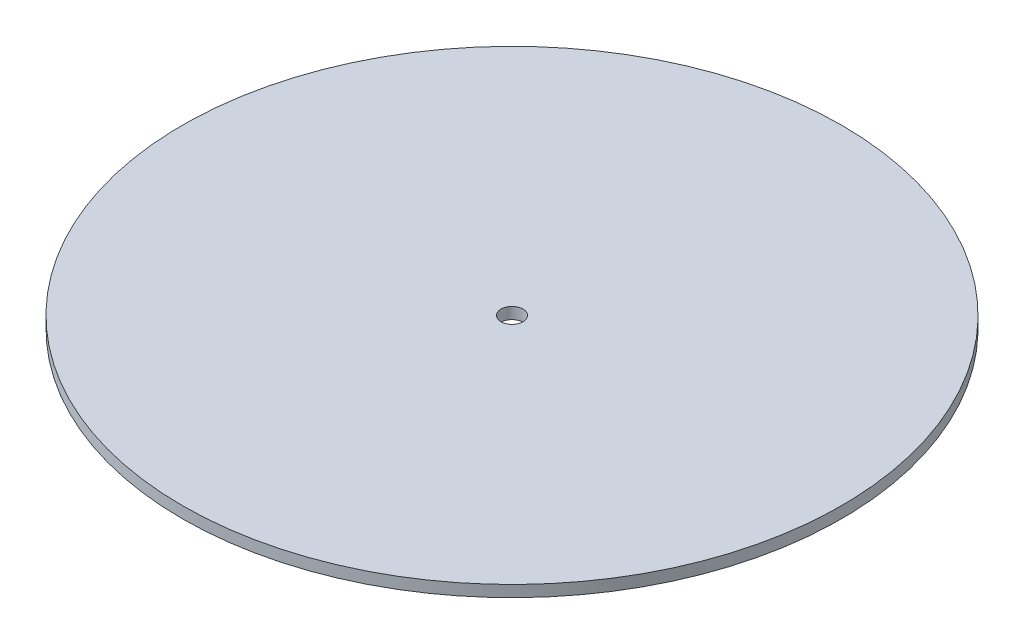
from build123d import *

# Parameters (mm, degrees)
SKETCH1_R           = 95.25
SKETCH1_R_2         = 3.175
BOSS_EXTRUDE1_DEPTH = 3.302


with BuildPart() as part:
    # Sketch1 → Boss-Extrude1 (new body)
    with BuildSketch(Plane(origin=(0, 0, 0), x_dir=(1, 0, 0), z_dir=(0, 1, 0))):
        with Locations(Location((0, 0, 0), (0, 0, 90))):
            Circle(SKETCH1_R)
        with Locations(Location((0, 0, 0), (0, 0, 90))):
            Circle(SKETCH1_R_2, mode=Mode.SUBTRACT)
    extrude(amount=BOSS_EXTRUDE1_DEPTH)


solid = part.part
